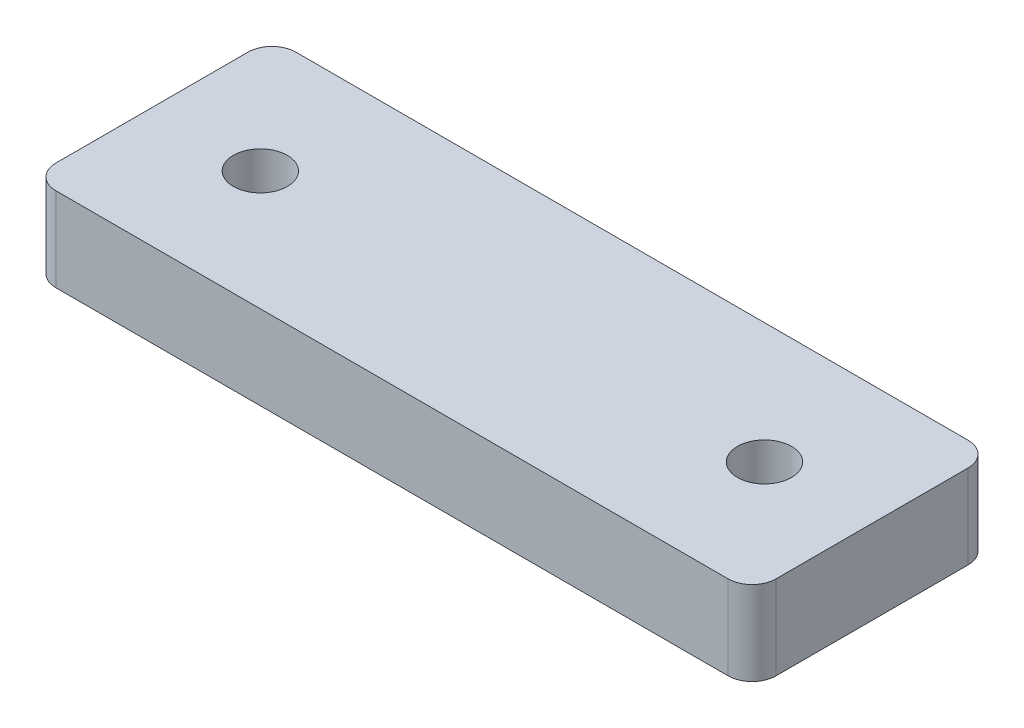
ISO-10303-21;
HEADER;
FILE_DESCRIPTION(('STEP AP214'),'2;1');
FILE_NAME('part.step','',(''),(''),'','','');
FILE_SCHEMA(('AUTOMOTIVE_DESIGN { 1 0 10303 214 1 1 1 1 }'));
ENDSEC;
DATA;
#1=APPLICATION_CONTEXT('core data for automotive mechanical design processes');
#2=APPLICATION_PROTOCOL_DEFINITION('international standard','automotive_design',2000,#1);
#3=PRODUCT_CONTEXT('',#1,'mechanical');
#4=PRODUCT('Part','Part','',(#3));
#5=PRODUCT_RELATED_PRODUCT_CATEGORY('part','',(#4));
#6=PRODUCT_DEFINITION_FORMATION('','',#4);
#7=PRODUCT_DEFINITION_CONTEXT('part definition',#1,'design');
#8=PRODUCT_DEFINITION('design','',#6,#7);
#9=PRODUCT_DEFINITION_SHAPE('','',#8);
#10=(LENGTH_UNIT() NAMED_UNIT(*) SI_UNIT(.MILLI.,.METRE.));
#11=(NAMED_UNIT(*) PLANE_ANGLE_UNIT() SI_UNIT($,.RADIAN.));
#12=(NAMED_UNIT(*) SI_UNIT($,.STERADIAN.) SOLID_ANGLE_UNIT());
#13=UNCERTAINTY_MEASURE_WITH_UNIT(LENGTH_MEASURE(1.E-05),#10,'distance_accuracy_value','');
#14=(GEOMETRIC_REPRESENTATION_CONTEXT(3) GLOBAL_UNCERTAINTY_ASSIGNED_CONTEXT((#13)) GLOBAL_UNIT_ASSIGNED_CONTEXT((#10,
#11,#12)) REPRESENTATION_CONTEXT('',''));
#15=CARTESIAN_POINT('',(0.,0.,0.));
#16=DIRECTION('',(0.,0.,1.));
#17=DIRECTION('',(1.,0.,0.));
#18=AXIS2_PLACEMENT_3D('',#15,#16,#17);
#19=CARTESIAN_POINT('',(-631.605409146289,53.1985922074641,20.));
#20=DIRECTION('',(1.,0.,0.));
#21=DIRECTION('',(0.,0.,-1.));
#22=AXIS2_PLACEMENT_3D('',#19,#20,#21);
#23=PLANE('',#22);
#24=DIRECTION('',(0.,0.,-1.));
#25=VECTOR('',#24,1.);
#26=CARTESIAN_POINT('',(-631.605409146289,46.1985922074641,20.));
#27=LINE('',#26,#25);
#28=CARTESIAN_POINT('',(-631.605409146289,46.1985922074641,18.));
#29=VERTEX_POINT('',#28);
#30=CARTESIAN_POINT('',(-631.605409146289,46.1985922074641,2.));
#31=VERTEX_POINT('',#30);
#32=EDGE_CURVE('E132',#29,#31,#27,.T.);
#33=ORIENTED_EDGE('',*,*,#32,.F.);
#34=DIRECTION('',(0.,-1.,0.));
#35=VECTOR('',#34,1.);
#36=CARTESIAN_POINT('',(-631.605409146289,53.1985922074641,18.));
#37=LINE('',#36,#35);
#38=CARTESIAN_POINT('',(-631.605409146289,53.1985922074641,18.));
#39=VERTEX_POINT('',#38);
#40=EDGE_CURVE('E11',#29,#39,#37,.F.);
#41=ORIENTED_EDGE('',*,*,#40,.T.);
#42=DIRECTION('',(0.,0.,-1.));
#43=VECTOR('',#42,1.);
#44=CARTESIAN_POINT('',(-631.605409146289,53.1985922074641,20.));
#45=LINE('',#44,#43);
#46=CARTESIAN_POINT('',(-631.605409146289,53.1985922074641,2.));
#47=VERTEX_POINT('',#46);
#48=EDGE_CURVE('E127',#39,#47,#45,.T.);
#49=ORIENTED_EDGE('',*,*,#48,.T.);
#50=DIRECTION('',(0.,-1.,0.));
#51=VECTOR('',#50,1.);
#52=CARTESIAN_POINT('',(-631.605409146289,53.1985922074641,2.));
#53=LINE('',#52,#51);
#54=EDGE_CURVE('E47',#47,#31,#53,.T.);
#55=ORIENTED_EDGE('',*,*,#54,.T.);
#56=EDGE_LOOP('',(#33,#41,#49,#55));
#57=FACE_BOUND('',#56,.T.);
#58=ADVANCED_FACE('F39',(#57),#23,.F.);
#59=CARTESIAN_POINT('',(-631.605409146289,46.1985922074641,20.));
#60=DIRECTION('',(0.,1.,0.));
#61=DIRECTION('',(0.,0.,1.));
#62=AXIS2_PLACEMENT_3D('',#59,#60,#61);
#63=PLANE('',#62);
#64=CARTESIAN_POINT('',(-622.521961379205,46.1985922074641,10.0500000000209));
#65=DIRECTION('',(0.,1.,0.));
#66=DIRECTION('',(0.,0.,1.));
#67=AXIS2_PLACEMENT_3D('',#64,#65,#66);
#68=CIRCLE('',#67,2.25000000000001);
#69=CARTESIAN_POINT('',(-622.521961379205,46.1985922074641,12.3000000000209));
#70=VERTEX_POINT('',#69);
#71=EDGE_CURVE('E223',#70,#70,#68,.T.);
#72=ORIENTED_EDGE('',*,*,#71,.T.);
#73=EDGE_LOOP('',(#72));
#74=FACE_BOUND('',#73,.T.);
#75=CARTESIAN_POINT('',(-580.521961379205,46.1985922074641,10.0500000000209));
#76=DIRECTION('',(0.,1.,0.));
#77=DIRECTION('',(0.,0.,1.));
#78=AXIS2_PLACEMENT_3D('',#75,#76,#77);
#79=CIRCLE('',#78,2.25000000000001);
#80=CARTESIAN_POINT('',(-580.521961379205,46.1985922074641,12.3000000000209));
#81=VERTEX_POINT('',#80);
#82=EDGE_CURVE('E171',#81,#81,#79,.T.);
#83=ORIENTED_EDGE('',*,*,#82,.T.);
#84=EDGE_LOOP('',(#83));
#85=FACE_BOUND('',#84,.T.);
#86=DIRECTION('',(1.,0.,0.));
#87=VECTOR('',#86,1.);
#88=CARTESIAN_POINT('',(-631.605409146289,46.1985922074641,0.));
#89=LINE('',#88,#87);
#90=CARTESIAN_POINT('',(-629.605409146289,46.1985922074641,0.));
#91=VERTEX_POINT('',#90);
#92=CARTESIAN_POINT('',(-573.605409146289,46.1985922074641,0.));
#93=VERTEX_POINT('',#92);
#94=EDGE_CURVE('E163',#91,#93,#89,.T.);
#95=ORIENTED_EDGE('',*,*,#94,.T.);
#96=CARTESIAN_POINT('',(-573.605409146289,46.1985922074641,2.));
#97=DIRECTION('',(0.,1.,0.));
#98=DIRECTION('',(0.,0.,1.));
#99=AXIS2_PLACEMENT_3D('',#96,#97,#98);
#100=CIRCLE('',#99,2.);
#101=CARTESIAN_POINT('',(-571.605409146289,46.1985922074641,2.));
#102=VERTEX_POINT('',#101);
#103=EDGE_CURVE('E149',#93,#102,#100,.F.);
#104=ORIENTED_EDGE('',*,*,#103,.T.);
#105=DIRECTION('',(0.,0.,-1.));
#106=VECTOR('',#105,1.);
#107=CARTESIAN_POINT('',(-571.605409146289,46.1985922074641,20.));
#108=LINE('',#107,#106);
#109=CARTESIAN_POINT('',(-571.605409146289,46.1985922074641,18.));
#110=VERTEX_POINT('',#109);
#111=EDGE_CURVE('E126',#110,#102,#108,.T.);
#112=ORIENTED_EDGE('',*,*,#111,.F.);
#113=CARTESIAN_POINT('',(-573.605409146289,46.1985922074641,18.));
#114=DIRECTION('',(0.,1.,0.));
#115=DIRECTION('',(0.,0.,1.));
#116=AXIS2_PLACEMENT_3D('',#113,#114,#115);
#117=CIRCLE('',#116,2.);
#118=CARTESIAN_POINT('',(-573.605409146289,46.1985922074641,20.));
#119=VERTEX_POINT('',#118);
#120=EDGE_CURVE('E131',#110,#119,#117,.F.);
#121=ORIENTED_EDGE('',*,*,#120,.T.);
#122=DIRECTION('',(1.,0.,0.));
#123=VECTOR('',#122,1.);
#124=CARTESIAN_POINT('',(-631.605409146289,46.1985922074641,20.));
#125=LINE('',#124,#123);
#126=CARTESIAN_POINT('',(-629.605409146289,46.1985922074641,20.));
#127=VERTEX_POINT('',#126);
#128=EDGE_CURVE('E174',#127,#119,#125,.T.);
#129=ORIENTED_EDGE('',*,*,#128,.F.);
#130=CARTESIAN_POINT('',(-629.605409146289,46.1985922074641,18.));
#131=DIRECTION('',(0.,1.,0.));
#132=DIRECTION('',(0.,0.,1.));
#133=AXIS2_PLACEMENT_3D('',#130,#131,#132);
#134=CIRCLE('',#133,2.);
#135=EDGE_CURVE('E62',#127,#29,#134,.F.);
#136=ORIENTED_EDGE('',*,*,#135,.T.);
#137=ORIENTED_EDGE('',*,*,#32,.T.);
#138=CARTESIAN_POINT('',(-629.605409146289,46.1985922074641,2.));
#139=DIRECTION('',(0.,1.,0.));
#140=DIRECTION('',(0.,0.,1.));
#141=AXIS2_PLACEMENT_3D('',#138,#139,#140);
#142=CIRCLE('',#141,2.);
#143=EDGE_CURVE('E54',#31,#91,#142,.F.);
#144=ORIENTED_EDGE('',*,*,#143,.T.);
#145=EDGE_LOOP('',(#95,#104,#112,#121,#129,#136,#137,#144));
#146=FACE_BOUND('',#145,.T.);
#147=ADVANCED_FACE('F161',(#74,#85,#146),#63,.F.);
#148=CARTESIAN_POINT('',(-571.605409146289,53.1985922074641,20.));
#149=DIRECTION('',(-1.,0.,0.));
#150=DIRECTION('',(0.,0.,1.));
#151=AXIS2_PLACEMENT_3D('',#148,#149,#150);
#152=PLANE('',#151);
#153=ORIENTED_EDGE('',*,*,#111,.T.);
#154=DIRECTION('',(0.,1.,0.));
#155=VECTOR('',#154,1.);
#156=CARTESIAN_POINT('',(-571.605409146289,53.1985922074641,2.));
#157=LINE('',#156,#155);
#158=CARTESIAN_POINT('',(-571.605409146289,53.1985922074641,2.));
#159=VERTEX_POINT('',#158);
#160=EDGE_CURVE('E125',#102,#159,#157,.T.);
#161=ORIENTED_EDGE('',*,*,#160,.T.);
#162=DIRECTION('',(0.,0.,-1.));
#163=VECTOR('',#162,1.);
#164=CARTESIAN_POINT('',(-571.605409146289,53.1985922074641,20.));
#165=LINE('',#164,#163);
#166=CARTESIAN_POINT('',(-571.605409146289,53.1985922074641,18.));
#167=VERTEX_POINT('',#166);
#168=EDGE_CURVE('E108',#167,#159,#165,.T.);
#169=ORIENTED_EDGE('',*,*,#168,.F.);
#170=DIRECTION('',(0.,1.,0.));
#171=VECTOR('',#170,1.);
#172=CARTESIAN_POINT('',(-571.605409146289,46.1985922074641,18.));
#173=LINE('',#172,#171);
#174=EDGE_CURVE('E122',#167,#110,#173,.F.);
#175=ORIENTED_EDGE('',*,*,#174,.T.);
#176=EDGE_LOOP('',(#153,#161,#169,#175));
#177=FACE_BOUND('',#176,.T.);
#178=ADVANCED_FACE('F121',(#177),#152,.F.);
#179=CARTESIAN_POINT('',(-631.605409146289,53.1985922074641,20.));
#180=DIRECTION('',(0.,-1.,0.));
#181=DIRECTION('',(0.,0.,-1.));
#182=AXIS2_PLACEMENT_3D('',#179,#180,#181);
#183=PLANE('',#182);
#184=CARTESIAN_POINT('',(-622.521961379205,53.1985922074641,10.0500000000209));
#185=DIRECTION('',(0.,1.,0.));
#186=DIRECTION('',(0.,0.,1.));
#187=AXIS2_PLACEMENT_3D('',#184,#185,#186);
#188=CIRCLE('',#187,2.25000000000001);
#189=CARTESIAN_POINT('',(-622.521961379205,53.1985922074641,12.3000000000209));
#190=VERTEX_POINT('',#189);
#191=EDGE_CURVE('E220',#190,#190,#188,.T.);
#192=ORIENTED_EDGE('',*,*,#191,.F.);
#193=EDGE_LOOP('',(#192));
#194=FACE_BOUND('',#193,.T.);
#195=CARTESIAN_POINT('',(-580.521961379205,53.1985922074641,10.0500000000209));
#196=DIRECTION('',(0.,1.,0.));
#197=DIRECTION('',(0.,0.,1.));
#198=AXIS2_PLACEMENT_3D('',#195,#196,#197);
#199=CIRCLE('',#198,2.25000000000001);
#200=CARTESIAN_POINT('',(-580.521961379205,53.1985922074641,12.3000000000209));
#201=VERTEX_POINT('',#200);
#202=EDGE_CURVE('E224',#201,#201,#199,.T.);
#203=ORIENTED_EDGE('',*,*,#202,.F.);
#204=EDGE_LOOP('',(#203));
#205=FACE_BOUND('',#204,.T.);
#206=ORIENTED_EDGE('',*,*,#168,.T.);
#207=CARTESIAN_POINT('',(-573.605409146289,53.1985922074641,2.));
#208=DIRECTION('',(0.,-1.,0.));
#209=DIRECTION('',(0.,0.,-1.));
#210=AXIS2_PLACEMENT_3D('',#207,#208,#209);
#211=CIRCLE('',#210,2.);
#212=CARTESIAN_POINT('',(-573.605409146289,53.1985922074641,0.));
#213=VERTEX_POINT('',#212);
#214=EDGE_CURVE('E115',#159,#213,#211,.F.);
#215=ORIENTED_EDGE('',*,*,#214,.T.);
#216=DIRECTION('',(-1.,0.,0.));
#217=VECTOR('',#216,1.);
#218=CARTESIAN_POINT('',(-631.605409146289,53.1985922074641,0.));
#219=LINE('',#218,#217);
#220=CARTESIAN_POINT('',(-629.605409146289,53.1985922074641,0.));
#221=VERTEX_POINT('',#220);
#222=EDGE_CURVE('E170',#213,#221,#219,.T.);
#223=ORIENTED_EDGE('',*,*,#222,.T.);
#224=CARTESIAN_POINT('',(-629.605409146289,53.1985922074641,2.));
#225=DIRECTION('',(0.,-1.,0.));
#226=DIRECTION('',(0.,0.,-1.));
#227=AXIS2_PLACEMENT_3D('',#224,#225,#226);
#228=CIRCLE('',#227,2.);
#229=EDGE_CURVE('E134',#221,#47,#228,.F.);
#230=ORIENTED_EDGE('',*,*,#229,.T.);
#231=ORIENTED_EDGE('',*,*,#48,.F.);
#232=CARTESIAN_POINT('',(-629.605409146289,53.1985922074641,18.));
#233=DIRECTION('',(0.,-1.,0.));
#234=DIRECTION('',(0.,0.,-1.));
#235=AXIS2_PLACEMENT_3D('',#232,#233,#234);
#236=CIRCLE('',#235,2.);
#237=CARTESIAN_POINT('',(-629.605409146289,53.1985922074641,20.));
#238=VERTEX_POINT('',#237);
#239=EDGE_CURVE('E116',#39,#238,#236,.F.);
#240=ORIENTED_EDGE('',*,*,#239,.T.);
#241=DIRECTION('',(-1.,0.,0.));
#242=VECTOR('',#241,1.);
#243=CARTESIAN_POINT('',(-631.605409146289,53.1985922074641,20.));
#244=LINE('',#243,#242);
#245=CARTESIAN_POINT('',(-573.605409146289,53.1985922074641,20.));
#246=VERTEX_POINT('',#245);
#247=EDGE_CURVE('E110',#246,#238,#244,.T.);
#248=ORIENTED_EDGE('',*,*,#247,.F.);
#249=CARTESIAN_POINT('',(-573.605409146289,53.1985922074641,18.));
#250=DIRECTION('',(0.,-1.,0.));
#251=DIRECTION('',(0.,0.,-1.));
#252=AXIS2_PLACEMENT_3D('',#249,#250,#251);
#253=CIRCLE('',#252,2.);
#254=EDGE_CURVE('E105',#246,#167,#253,.F.);
#255=ORIENTED_EDGE('',*,*,#254,.T.);
#256=EDGE_LOOP('',(#206,#215,#223,#230,#231,#240,#248,#255));
#257=FACE_BOUND('',#256,.T.);
#258=ADVANCED_FACE('F107',(#194,#205,#257),#183,.F.);
#259=CARTESIAN_POINT('',(0.,0.,20.));
#260=DIRECTION('',(0.,0.,1.));
#261=DIRECTION('',(1.,0.,0.));
#262=AXIS2_PLACEMENT_3D('',#259,#260,#261);
#263=PLANE('',#262);
#264=ORIENTED_EDGE('',*,*,#128,.T.);
#265=DIRECTION('',(0.,1.,0.));
#266=VECTOR('',#265,1.);
#267=CARTESIAN_POINT('',(-573.605409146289,53.1985922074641,20.));
#268=LINE('',#267,#266);
#269=EDGE_CURVE('E154',#119,#246,#268,.T.);
#270=ORIENTED_EDGE('',*,*,#269,.T.);
#271=ORIENTED_EDGE('',*,*,#247,.T.);
#272=DIRECTION('',(0.,-1.,0.));
#273=VECTOR('',#272,1.);
#274=CARTESIAN_POINT('',(-629.605409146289,46.1985922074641,20.));
#275=LINE('',#274,#273);
#276=EDGE_CURVE('E151',#238,#127,#275,.T.);
#277=ORIENTED_EDGE('',*,*,#276,.T.);
#278=EDGE_LOOP('',(#264,#270,#271,#277));
#279=FACE_BOUND('',#278,.T.);
#280=ADVANCED_FACE('F190',(#279),#263,.T.);
#281=CARTESIAN_POINT('',(0.,0.,0.));
#282=DIRECTION('',(0.,0.,1.));
#283=DIRECTION('',(1.,0.,0.));
#284=AXIS2_PLACEMENT_3D('',#281,#282,#283);
#285=PLANE('',#284);
#286=ORIENTED_EDGE('',*,*,#222,.F.);
#287=DIRECTION('',(0.,1.,0.));
#288=VECTOR('',#287,1.);
#289=CARTESIAN_POINT('',(-573.605409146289,0.,0.));
#290=LINE('',#289,#288);
#291=EDGE_CURVE('E144',#213,#93,#290,.F.);
#292=ORIENTED_EDGE('',*,*,#291,.T.);
#293=ORIENTED_EDGE('',*,*,#94,.F.);
#294=DIRECTION('',(0.,-1.,0.));
#295=VECTOR('',#294,1.);
#296=CARTESIAN_POINT('',(-629.605409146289,0.,0.));
#297=LINE('',#296,#295);
#298=EDGE_CURVE('E142',#91,#221,#297,.F.);
#299=ORIENTED_EDGE('',*,*,#298,.T.);
#300=EDGE_LOOP('',(#286,#292,#293,#299));
#301=FACE_BOUND('',#300,.T.);
#302=ADVANCED_FACE('F167',(#301),#285,.F.);
#303=CARTESIAN_POINT('',(-573.605409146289,53.1985922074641,2.));
#304=DIRECTION('',(0.,1.,0.));
#305=DIRECTION('',(0.,0.,1.));
#306=AXIS2_PLACEMENT_3D('',#303,#304,#305);
#307=CYLINDRICAL_SURFACE('',#306,2.);
#308=ORIENTED_EDGE('',*,*,#103,.F.);
#309=ORIENTED_EDGE('',*,*,#291,.F.);
#310=ORIENTED_EDGE('',*,*,#214,.F.);
#311=ORIENTED_EDGE('',*,*,#160,.F.);
#312=EDGE_LOOP('',(#308,#309,#310,#311));
#313=FACE_BOUND('',#312,.T.);
#314=ADVANCED_FACE('F181',(#313),#307,.T.);
#315=CARTESIAN_POINT('',(-573.605409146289,0.,18.));
#316=DIRECTION('',(0.,-1.,0.));
#317=DIRECTION('',(0.,0.,-1.));
#318=AXIS2_PLACEMENT_3D('',#315,#316,#317);
#319=CYLINDRICAL_SURFACE('',#318,2.);
#320=ORIENTED_EDGE('',*,*,#120,.F.);
#321=ORIENTED_EDGE('',*,*,#174,.F.);
#322=ORIENTED_EDGE('',*,*,#254,.F.);
#323=ORIENTED_EDGE('',*,*,#269,.F.);
#324=EDGE_LOOP('',(#320,#321,#322,#323));
#325=FACE_BOUND('',#324,.T.);
#326=ADVANCED_FACE('F130',(#325),#319,.T.);
#327=CARTESIAN_POINT('',(-629.605409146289,0.,18.));
#328=DIRECTION('',(0.,1.,0.));
#329=DIRECTION('',(0.,0.,1.));
#330=AXIS2_PLACEMENT_3D('',#327,#328,#329);
#331=CYLINDRICAL_SURFACE('',#330,2.);
#332=ORIENTED_EDGE('',*,*,#239,.F.);
#333=ORIENTED_EDGE('',*,*,#40,.F.);
#334=ORIENTED_EDGE('',*,*,#135,.F.);
#335=ORIENTED_EDGE('',*,*,#276,.F.);
#336=EDGE_LOOP('',(#332,#333,#334,#335));
#337=FACE_BOUND('',#336,.T.);
#338=ADVANCED_FACE('F188',(#337),#331,.T.);
#339=CARTESIAN_POINT('',(-629.605409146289,53.1985922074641,2.));
#340=DIRECTION('',(0.,-1.,0.));
#341=DIRECTION('',(0.,0.,-1.));
#342=AXIS2_PLACEMENT_3D('',#339,#340,#341);
#343=CYLINDRICAL_SURFACE('',#342,2.);
#344=ORIENTED_EDGE('',*,*,#229,.F.);
#345=ORIENTED_EDGE('',*,*,#298,.F.);
#346=ORIENTED_EDGE('',*,*,#143,.F.);
#347=ORIENTED_EDGE('',*,*,#54,.F.);
#348=EDGE_LOOP('',(#344,#345,#346,#347));
#349=FACE_BOUND('',#348,.T.);
#350=ADVANCED_FACE('F41',(#349),#343,.T.);
#351=CARTESIAN_POINT('',(-580.521961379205,33.1985922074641,10.0500000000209));
#352=DIRECTION('',(0.,1.,0.));
#353=DIRECTION('',(0.,0.,1.));
#354=AXIS2_PLACEMENT_3D('',#351,#352,#353);
#355=CYLINDRICAL_SURFACE('',#354,2.25000000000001);
#356=ORIENTED_EDGE('',*,*,#202,.T.);
#357=EDGE_LOOP('',(#356));
#358=FACE_BOUND('',#357,.T.);
#359=ORIENTED_EDGE('',*,*,#82,.F.);
#360=EDGE_LOOP('',(#359));
#361=FACE_BOUND('',#360,.T.);
#362=ADVANCED_FACE('F208',(#358,#361),#355,.F.);
#363=CARTESIAN_POINT('',(-622.521961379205,33.1985922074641,10.0500000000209));
#364=DIRECTION('',(0.,1.,0.));
#365=DIRECTION('',(0.,0.,1.));
#366=AXIS2_PLACEMENT_3D('',#363,#364,#365);
#367=CYLINDRICAL_SURFACE('',#366,2.25000000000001);
#368=ORIENTED_EDGE('',*,*,#191,.T.);
#369=EDGE_LOOP('',(#368));
#370=FACE_BOUND('',#369,.T.);
#371=ORIENTED_EDGE('',*,*,#71,.F.);
#372=EDGE_LOOP('',(#371));
#373=FACE_BOUND('',#372,.T.);
#374=ADVANCED_FACE('F211',(#370,#373),#367,.F.);
#375=CLOSED_SHELL('',(#58,#147,#178,#258,#280,#302,#314,#326,#338,#350,#362,#374));
#376=MANIFOLD_SOLID_BREP('B2',#375);
#377=ADVANCED_BREP_SHAPE_REPRESENTATION('',(#18,#376),#14);
#378=SHAPE_DEFINITION_REPRESENTATION(#9,#377);
ENDSEC;
END-ISO-10303-21;
